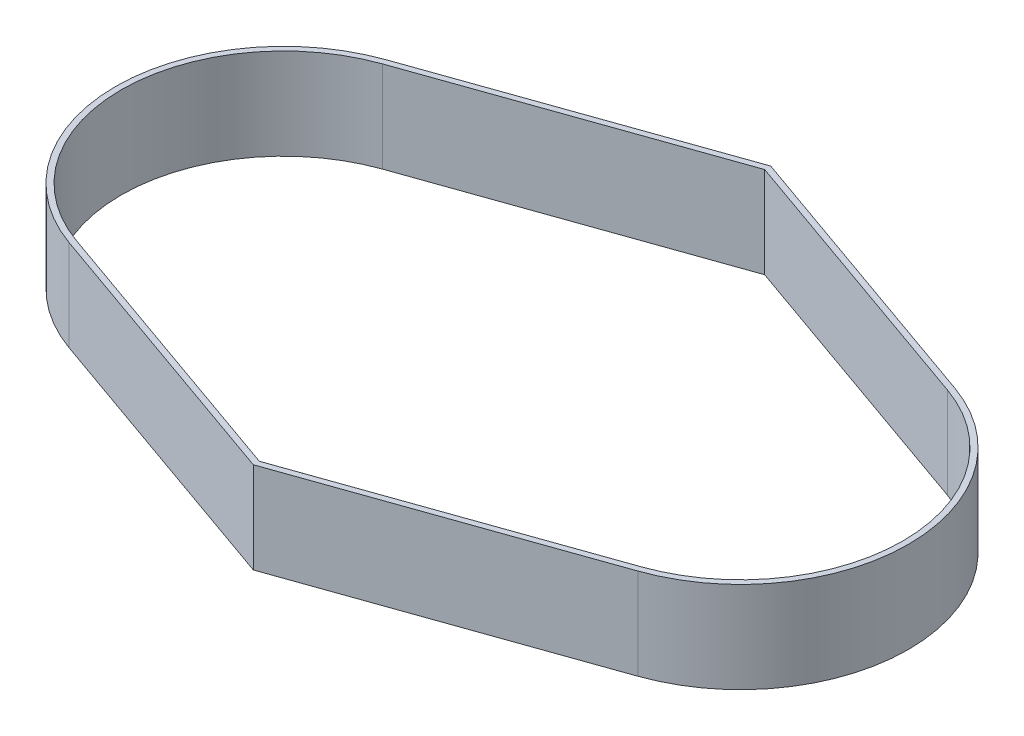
ISO-10303-21;
HEADER;
FILE_DESCRIPTION(('STEP AP214'),'2;1');
FILE_NAME('part.step','',(''),(''),'','','');
FILE_SCHEMA(('AUTOMOTIVE_DESIGN { 1 0 10303 214 1 1 1 1 }'));
ENDSEC;
DATA;
#1=APPLICATION_CONTEXT('core data for automotive mechanical design processes');
#2=APPLICATION_PROTOCOL_DEFINITION('international standard','automotive_design',2000,#1);
#3=PRODUCT_CONTEXT('',#1,'mechanical');
#4=PRODUCT('Part','Part','',(#3));
#5=PRODUCT_RELATED_PRODUCT_CATEGORY('part','',(#4));
#6=PRODUCT_DEFINITION_FORMATION('','',#4);
#7=PRODUCT_DEFINITION_CONTEXT('part definition',#1,'design');
#8=PRODUCT_DEFINITION('design','',#6,#7);
#9=PRODUCT_DEFINITION_SHAPE('','',#8);
#10=(LENGTH_UNIT() NAMED_UNIT(*) SI_UNIT(.MILLI.,.METRE.));
#11=(NAMED_UNIT(*) PLANE_ANGLE_UNIT() SI_UNIT($,.RADIAN.));
#12=(NAMED_UNIT(*) SI_UNIT($,.STERADIAN.) SOLID_ANGLE_UNIT());
#13=UNCERTAINTY_MEASURE_WITH_UNIT(LENGTH_MEASURE(1.E-05),#10,'distance_accuracy_value','');
#14=(GEOMETRIC_REPRESENTATION_CONTEXT(3) GLOBAL_UNCERTAINTY_ASSIGNED_CONTEXT((#13)) GLOBAL_UNIT_ASSIGNED_CONTEXT((#10,
#11,#12)) REPRESENTATION_CONTEXT('',''));
#15=CARTESIAN_POINT('',(0.,0.,0.));
#16=DIRECTION('',(0.,0.,1.));
#17=DIRECTION('',(1.,0.,0.));
#18=AXIS2_PLACEMENT_3D('',#15,#16,#17);
#19=CARTESIAN_POINT('',(-127.367353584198,50.8,0.));
#20=DIRECTION('',(0.,1.,0.));
#21=DIRECTION('',(0.,0.,1.));
#22=AXIS2_PLACEMENT_3D('',#19,#20,#21);
#23=PLANE('',#22);
#24=CARTESIAN_POINT('',(-127.367353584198,50.8,0.));
#25=DIRECTION('',(0.,1.,0.));
#26=DIRECTION('',(0.,0.,1.));
#27=AXIS2_PLACEMENT_3D('',#24,#25,#26);
#28=CIRCLE('',#27,93.6625);
#29=CARTESIAN_POINT('',(-158.505524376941,50.8,-88.3350339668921));
#30=VERTEX_POINT('',#29);
#31=CARTESIAN_POINT('',(-158.505524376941,50.8,88.3350339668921));
#32=VERTEX_POINT('',#31);
#33=EDGE_CURVE('E213',#30,#32,#28,.T.);
#34=ORIENTED_EDGE('',*,*,#33,.T.);
#35=DIRECTION('',(0.943120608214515,0.,0.332450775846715));
#36=VECTOR('',#35,1.);
#37=CARTESIAN_POINT('',(-158.505524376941,50.8,88.3350339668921));
#38=LINE('',#37,#36);
#39=CARTESIAN_POINT('',(0.,50.8,144.20835928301));
#40=VERTEX_POINT('',#39);
#41=EDGE_CURVE('E217',#32,#40,#38,.T.);
#42=ORIENTED_EDGE('',*,*,#41,.T.);
#43=DIRECTION('',(0.943120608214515,0.,-0.332450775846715));
#44=VECTOR('',#43,1.);
#45=CARTESIAN_POINT('',(158.505524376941,50.8,88.3350339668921));
#46=LINE('',#45,#44);
#47=CARTESIAN_POINT('',(158.505524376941,50.8,88.3350339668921));
#48=VERTEX_POINT('',#47);
#49=EDGE_CURVE('E220',#40,#48,#46,.T.);
#50=ORIENTED_EDGE('',*,*,#49,.T.);
#51=CARTESIAN_POINT('',(127.367353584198,50.8,0.));
#52=DIRECTION('',(0.,1.,0.));
#53=DIRECTION('',(0.,0.,-1.));
#54=AXIS2_PLACEMENT_3D('',#51,#52,#53);
#55=CIRCLE('',#54,93.6625);
#56=CARTESIAN_POINT('',(158.505524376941,50.8,-88.3350339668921));
#57=VERTEX_POINT('',#56);
#58=EDGE_CURVE('E223',#48,#57,#55,.T.);
#59=ORIENTED_EDGE('',*,*,#58,.T.);
#60=DIRECTION('',(-0.943120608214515,0.,-0.332450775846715));
#61=VECTOR('',#60,1.);
#62=CARTESIAN_POINT('',(158.505524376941,50.8,-88.3350339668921));
#63=LINE('',#62,#61);
#64=CARTESIAN_POINT('',(0.,50.8,-144.20835928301));
#65=VERTEX_POINT('',#64);
#66=EDGE_CURVE('E226',#57,#65,#63,.T.);
#67=ORIENTED_EDGE('',*,*,#66,.T.);
#68=DIRECTION('',(-0.943120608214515,0.,0.332450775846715));
#69=VECTOR('',#68,1.);
#70=CARTESIAN_POINT('',(-158.505524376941,50.8,-88.3350339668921));
#71=LINE('',#70,#69);
#72=EDGE_CURVE('E228',#65,#30,#71,.T.);
#73=ORIENTED_EDGE('',*,*,#72,.T.);
#74=EDGE_LOOP('',(#34,#42,#50,#59,#67,#73));
#75=FACE_BOUND('',#74,.T.);
#76=DIRECTION('',(0.943120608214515,0.,0.332450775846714));
#77=VECTOR('',#76,1.);
#78=CARTESIAN_POINT('',(-157.449993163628,50.8,85.340626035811));
#79=LINE('',#78,#77);
#80=CARTESIAN_POINT('',(-157.449993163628,50.8,85.340626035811));
#81=VERTEX_POINT('',#80);
#82=CARTESIAN_POINT('',(0.,50.8,140.841875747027));
#83=VERTEX_POINT('',#82);
#84=EDGE_CURVE('E155',#81,#83,#79,.T.);
#85=ORIENTED_EDGE('',*,*,#84,.F.);
#86=CARTESIAN_POINT('',(-127.367353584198,50.8,0.));
#87=DIRECTION('',(0.,1.,0.));
#88=DIRECTION('',(0.,0.,1.));
#89=AXIS2_PLACEMENT_3D('',#86,#87,#88);
#90=CIRCLE('',#89,90.4875);
#91=CARTESIAN_POINT('',(-157.449993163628,50.8,-85.340626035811));
#92=VERTEX_POINT('',#91);
#93=EDGE_CURVE('E146',#92,#81,#90,.T.);
#94=ORIENTED_EDGE('',*,*,#93,.F.);
#95=DIRECTION('',(-0.943120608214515,0.,0.332450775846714));
#96=VECTOR('',#95,1.);
#97=CARTESIAN_POINT('',(-157.449993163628,50.8,-85.340626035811));
#98=LINE('',#97,#96);
#99=CARTESIAN_POINT('',(0.,50.8,-140.841875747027));
#100=VERTEX_POINT('',#99);
#101=EDGE_CURVE('E182',#100,#92,#98,.T.);
#102=ORIENTED_EDGE('',*,*,#101,.F.);
#103=DIRECTION('',(-0.943120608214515,0.,-0.332450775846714));
#104=VECTOR('',#103,1.);
#105=CARTESIAN_POINT('',(157.449993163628,50.8,-85.340626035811));
#106=LINE('',#105,#104);
#107=CARTESIAN_POINT('',(157.449993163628,50.8,-85.340626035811));
#108=VERTEX_POINT('',#107);
#109=EDGE_CURVE('E180',#108,#100,#106,.T.);
#110=ORIENTED_EDGE('',*,*,#109,.F.);
#111=CARTESIAN_POINT('',(127.367353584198,50.8,0.));
#112=DIRECTION('',(0.,1.,0.));
#113=DIRECTION('',(0.,0.,-1.));
#114=AXIS2_PLACEMENT_3D('',#111,#112,#113);
#115=CIRCLE('',#114,90.4875);
#116=CARTESIAN_POINT('',(157.449993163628,50.8,85.3406260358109));
#117=VERTEX_POINT('',#116);
#118=EDGE_CURVE('E175',#117,#108,#115,.T.);
#119=ORIENTED_EDGE('',*,*,#118,.F.);
#120=DIRECTION('',(0.943120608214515,0.,-0.332450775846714));
#121=VECTOR('',#120,1.);
#122=CARTESIAN_POINT('',(157.449993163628,50.8,85.340626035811));
#123=LINE('',#122,#121);
#124=EDGE_CURVE('E169',#83,#117,#123,.T.);
#125=ORIENTED_EDGE('',*,*,#124,.F.);
#126=EDGE_LOOP('',(#85,#94,#102,#110,#119,#125));
#127=FACE_BOUND('',#126,.T.);
#128=ADVANCED_FACE('F44',(#75,#127),#23,.T.);
#129=CARTESIAN_POINT('',(-127.367353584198,0.,0.));
#130=DIRECTION('',(0.,1.,0.));
#131=DIRECTION('',(0.,0.,1.));
#132=AXIS2_PLACEMENT_3D('',#129,#130,#131);
#133=PLANE('',#132);
#134=CARTESIAN_POINT('',(-127.367353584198,0.,0.));
#135=DIRECTION('',(0.,1.,0.));
#136=DIRECTION('',(0.,0.,1.));
#137=AXIS2_PLACEMENT_3D('',#134,#135,#136);
#138=CIRCLE('',#137,93.6625);
#139=CARTESIAN_POINT('',(-158.505524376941,0.,-88.3350339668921));
#140=VERTEX_POINT('',#139);
#141=CARTESIAN_POINT('',(-158.505524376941,0.,88.3350339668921));
#142=VERTEX_POINT('',#141);
#143=EDGE_CURVE('E164',#140,#142,#138,.T.);
#144=ORIENTED_EDGE('',*,*,#143,.F.);
#145=DIRECTION('',(-0.943120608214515,0.,0.332450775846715));
#146=VECTOR('',#145,1.);
#147=CARTESIAN_POINT('',(-158.505524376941,0.,-88.3350339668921));
#148=LINE('',#147,#146);
#149=CARTESIAN_POINT('',(0.,0.,-144.20835928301));
#150=VERTEX_POINT('',#149);
#151=EDGE_CURVE('E218',#150,#140,#148,.T.);
#152=ORIENTED_EDGE('',*,*,#151,.F.);
#153=DIRECTION('',(-0.943120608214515,0.,-0.332450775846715));
#154=VECTOR('',#153,1.);
#155=CARTESIAN_POINT('',(158.505524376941,0.,-88.3350339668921));
#156=LINE('',#155,#154);
#157=CARTESIAN_POINT('',(158.505524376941,0.,-88.3350339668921));
#158=VERTEX_POINT('',#157);
#159=EDGE_CURVE('E243',#158,#150,#156,.T.);
#160=ORIENTED_EDGE('',*,*,#159,.F.);
#161=CARTESIAN_POINT('',(127.367353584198,0.,0.));
#162=DIRECTION('',(0.,1.,0.));
#163=DIRECTION('',(0.,0.,-1.));
#164=AXIS2_PLACEMENT_3D('',#161,#162,#163);
#165=CIRCLE('',#164,93.6625);
#166=CARTESIAN_POINT('',(158.505524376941,0.,88.3350339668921));
#167=VERTEX_POINT('',#166);
#168=EDGE_CURVE('E241',#167,#158,#165,.T.);
#169=ORIENTED_EDGE('',*,*,#168,.F.);
#170=DIRECTION('',(0.943120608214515,0.,-0.332450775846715));
#171=VECTOR('',#170,1.);
#172=CARTESIAN_POINT('',(158.505524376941,0.,88.3350339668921));
#173=LINE('',#172,#171);
#174=CARTESIAN_POINT('',(0.,0.,144.20835928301));
#175=VERTEX_POINT('',#174);
#176=EDGE_CURVE('E238',#175,#167,#173,.T.);
#177=ORIENTED_EDGE('',*,*,#176,.F.);
#178=DIRECTION('',(0.943120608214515,0.,0.332450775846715));
#179=VECTOR('',#178,1.);
#180=CARTESIAN_POINT('',(-158.505524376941,0.,88.3350339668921));
#181=LINE('',#180,#179);
#182=EDGE_CURVE('E235',#142,#175,#181,.T.);
#183=ORIENTED_EDGE('',*,*,#182,.F.);
#184=EDGE_LOOP('',(#144,#152,#160,#169,#177,#183));
#185=FACE_BOUND('',#184,.T.);
#186=CARTESIAN_POINT('',(-127.367353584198,0.,0.));
#187=DIRECTION('',(0.,1.,0.));
#188=DIRECTION('',(0.,0.,1.));
#189=AXIS2_PLACEMENT_3D('',#186,#187,#188);
#190=CIRCLE('',#189,90.4875);
#191=CARTESIAN_POINT('',(-157.449993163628,0.,-85.340626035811));
#192=VERTEX_POINT('',#191);
#193=CARTESIAN_POINT('',(-157.449993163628,0.,85.340626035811));
#194=VERTEX_POINT('',#193);
#195=EDGE_CURVE('E71',#192,#194,#190,.T.);
#196=ORIENTED_EDGE('',*,*,#195,.T.);
#197=DIRECTION('',(0.943120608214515,0.,0.332450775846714));
#198=VECTOR('',#197,1.);
#199=CARTESIAN_POINT('',(-157.449993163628,0.,85.340626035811));
#200=LINE('',#199,#198);
#201=CARTESIAN_POINT('',(0.,0.,140.841875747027));
#202=VERTEX_POINT('',#201);
#203=EDGE_CURVE('E162',#194,#202,#200,.T.);
#204=ORIENTED_EDGE('',*,*,#203,.T.);
#205=DIRECTION('',(0.943120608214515,0.,-0.332450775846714));
#206=VECTOR('',#205,1.);
#207=CARTESIAN_POINT('',(157.449993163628,0.,85.340626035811));
#208=LINE('',#207,#206);
#209=CARTESIAN_POINT('',(157.449993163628,0.,85.3406260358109));
#210=VERTEX_POINT('',#209);
#211=EDGE_CURVE('E189',#202,#210,#208,.T.);
#212=ORIENTED_EDGE('',*,*,#211,.T.);
#213=CARTESIAN_POINT('',(127.367353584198,0.,0.));
#214=DIRECTION('',(0.,1.,0.));
#215=DIRECTION('',(0.,0.,-1.));
#216=AXIS2_PLACEMENT_3D('',#213,#214,#215);
#217=CIRCLE('',#216,90.4875);
#218=CARTESIAN_POINT('',(157.449993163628,0.,-85.340626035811));
#219=VERTEX_POINT('',#218);
#220=EDGE_CURVE('E193',#210,#219,#217,.T.);
#221=ORIENTED_EDGE('',*,*,#220,.T.);
#222=DIRECTION('',(-0.943120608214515,0.,-0.332450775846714));
#223=VECTOR('',#222,1.);
#224=CARTESIAN_POINT('',(157.449993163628,0.,-85.340626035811));
#225=LINE('',#224,#223);
#226=CARTESIAN_POINT('',(0.,0.,-140.841875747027));
#227=VERTEX_POINT('',#226);
#228=EDGE_CURVE('E196',#219,#227,#225,.T.);
#229=ORIENTED_EDGE('',*,*,#228,.T.);
#230=DIRECTION('',(-0.943120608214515,0.,0.332450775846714));
#231=VECTOR('',#230,1.);
#232=CARTESIAN_POINT('',(-157.449993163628,0.,-85.340626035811));
#233=LINE('',#232,#231);
#234=EDGE_CURVE('E156',#227,#192,#233,.T.);
#235=ORIENTED_EDGE('',*,*,#234,.T.);
#236=EDGE_LOOP('',(#196,#204,#212,#221,#229,#235));
#237=FACE_BOUND('',#236,.T.);
#238=ADVANCED_FACE('F271',(#185,#237),#133,.F.);
#239=CARTESIAN_POINT('',(-127.367353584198,50.8,0.));
#240=DIRECTION('',(0.,-1.,0.));
#241=DIRECTION('',(0.,0.,-1.));
#242=AXIS2_PLACEMENT_3D('',#239,#240,#241);
#243=CYLINDRICAL_SURFACE('',#242,93.6625);
#244=ORIENTED_EDGE('',*,*,#143,.T.);
#245=DIRECTION('',(0.,-1.,0.));
#246=VECTOR('',#245,1.);
#247=CARTESIAN_POINT('',(-158.505524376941,50.8,88.3350339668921));
#248=LINE('',#247,#246);
#249=EDGE_CURVE('E11',#32,#142,#248,.T.);
#250=ORIENTED_EDGE('',*,*,#249,.F.);
#251=ORIENTED_EDGE('',*,*,#33,.F.);
#252=DIRECTION('',(0.,-1.,0.));
#253=VECTOR('',#252,1.);
#254=CARTESIAN_POINT('',(-158.505524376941,50.8,-88.3350339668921));
#255=LINE('',#254,#253);
#256=EDGE_CURVE('E231',#30,#140,#255,.T.);
#257=ORIENTED_EDGE('',*,*,#256,.T.);
#258=EDGE_LOOP('',(#244,#250,#251,#257));
#259=FACE_BOUND('',#258,.T.);
#260=ADVANCED_FACE('F46',(#259),#243,.T.);
#261=CARTESIAN_POINT('',(-158.505524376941,50.8,88.3350339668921));
#262=DIRECTION('',(0.332450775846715,0.,-0.943120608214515));
#263=DIRECTION('',(-0.943120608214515,0.,-0.332450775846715));
#264=AXIS2_PLACEMENT_3D('',#261,#262,#263);
#265=PLANE('',#264);
#266=ORIENTED_EDGE('',*,*,#182,.T.);
#267=DIRECTION('',(0.,-1.,0.));
#268=VECTOR('',#267,1.);
#269=CARTESIAN_POINT('',(0.,50.8,144.20835928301));
#270=LINE('',#269,#268);
#271=EDGE_CURVE('E53',#40,#175,#270,.T.);
#272=ORIENTED_EDGE('',*,*,#271,.F.);
#273=ORIENTED_EDGE('',*,*,#41,.F.);
#274=ORIENTED_EDGE('',*,*,#249,.T.);
#275=EDGE_LOOP('',(#266,#272,#273,#274));
#276=FACE_BOUND('',#275,.T.);
#277=ADVANCED_FACE('F288',(#276),#265,.F.);
#278=CARTESIAN_POINT('',(158.505524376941,50.8,88.3350339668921));
#279=DIRECTION('',(-0.332450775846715,0.,-0.943120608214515));
#280=DIRECTION('',(-0.943120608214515,0.,0.332450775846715));
#281=AXIS2_PLACEMENT_3D('',#278,#279,#280);
#282=PLANE('',#281);
#283=ORIENTED_EDGE('',*,*,#176,.T.);
#284=DIRECTION('',(0.,-1.,0.));
#285=VECTOR('',#284,1.);
#286=CARTESIAN_POINT('',(158.505524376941,50.8,88.3350339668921));
#287=LINE('',#286,#285);
#288=EDGE_CURVE('E257',#48,#167,#287,.T.);
#289=ORIENTED_EDGE('',*,*,#288,.F.);
#290=ORIENTED_EDGE('',*,*,#49,.F.);
#291=ORIENTED_EDGE('',*,*,#271,.T.);
#292=EDGE_LOOP('',(#283,#289,#290,#291));
#293=FACE_BOUND('',#292,.T.);
#294=ADVANCED_FACE('F265',(#293),#282,.F.);
#295=CARTESIAN_POINT('',(127.367353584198,50.8,0.));
#296=DIRECTION('',(0.,-1.,0.));
#297=DIRECTION('',(0.,0.,-1.));
#298=AXIS2_PLACEMENT_3D('',#295,#296,#297);
#299=CYLINDRICAL_SURFACE('',#298,93.6625);
#300=ORIENTED_EDGE('',*,*,#168,.T.);
#301=DIRECTION('',(0.,-1.,0.));
#302=VECTOR('',#301,1.);
#303=CARTESIAN_POINT('',(158.505524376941,50.8,-88.3350339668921));
#304=LINE('',#303,#302);
#305=EDGE_CURVE('E254',#57,#158,#304,.T.);
#306=ORIENTED_EDGE('',*,*,#305,.F.);
#307=ORIENTED_EDGE('',*,*,#58,.F.);
#308=ORIENTED_EDGE('',*,*,#288,.T.);
#309=EDGE_LOOP('',(#300,#306,#307,#308));
#310=FACE_BOUND('',#309,.T.);
#311=ADVANCED_FACE('F277',(#310),#299,.T.);
#312=CARTESIAN_POINT('',(158.505524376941,50.8,-88.3350339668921));
#313=DIRECTION('',(-0.332450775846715,0.,0.943120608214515));
#314=DIRECTION('',(0.943120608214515,0.,0.332450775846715));
#315=AXIS2_PLACEMENT_3D('',#312,#313,#314);
#316=PLANE('',#315);
#317=ORIENTED_EDGE('',*,*,#159,.T.);
#318=DIRECTION('',(0.,-1.,0.));
#319=VECTOR('',#318,1.);
#320=CARTESIAN_POINT('',(0.,50.8,-144.20835928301));
#321=LINE('',#320,#319);
#322=EDGE_CURVE('E250',#65,#150,#321,.T.);
#323=ORIENTED_EDGE('',*,*,#322,.F.);
#324=ORIENTED_EDGE('',*,*,#66,.F.);
#325=ORIENTED_EDGE('',*,*,#305,.T.);
#326=EDGE_LOOP('',(#317,#323,#324,#325));
#327=FACE_BOUND('',#326,.T.);
#328=ADVANCED_FACE('F281',(#327),#316,.F.);
#329=CARTESIAN_POINT('',(-158.505524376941,50.8,-88.3350339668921));
#330=DIRECTION('',(0.332450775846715,0.,0.943120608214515));
#331=DIRECTION('',(0.943120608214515,0.,-0.332450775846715));
#332=AXIS2_PLACEMENT_3D('',#329,#330,#331);
#333=PLANE('',#332);
#334=ORIENTED_EDGE('',*,*,#151,.T.);
#335=ORIENTED_EDGE('',*,*,#256,.F.);
#336=ORIENTED_EDGE('',*,*,#72,.F.);
#337=ORIENTED_EDGE('',*,*,#322,.T.);
#338=EDGE_LOOP('',(#334,#335,#336,#337));
#339=FACE_BOUND('',#338,.T.);
#340=ADVANCED_FACE('F291',(#339),#333,.F.);
#341=CARTESIAN_POINT('',(-127.367353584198,50.8,0.));
#342=DIRECTION('',(0.,-1.,0.));
#343=DIRECTION('',(0.,0.,-1.));
#344=AXIS2_PLACEMENT_3D('',#341,#342,#343);
#345=CYLINDRICAL_SURFACE('',#344,90.4875);
#346=ORIENTED_EDGE('',*,*,#195,.F.);
#347=DIRECTION('',(0.,-1.,0.));
#348=VECTOR('',#347,1.);
#349=CARTESIAN_POINT('',(-157.449993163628,50.8,-85.340626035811));
#350=LINE('',#349,#348);
#351=EDGE_CURVE('E150',#92,#192,#350,.T.);
#352=ORIENTED_EDGE('',*,*,#351,.F.);
#353=ORIENTED_EDGE('',*,*,#93,.T.);
#354=DIRECTION('',(0.,-1.,0.));
#355=VECTOR('',#354,1.);
#356=CARTESIAN_POINT('',(-157.449993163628,50.8,85.340626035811));
#357=LINE('',#356,#355);
#358=EDGE_CURVE('E149',#81,#194,#357,.T.);
#359=ORIENTED_EDGE('',*,*,#358,.T.);
#360=EDGE_LOOP('',(#346,#352,#353,#359));
#361=FACE_BOUND('',#360,.T.);
#362=ADVANCED_FACE('F148',(#361),#345,.F.);
#363=CARTESIAN_POINT('',(-157.449993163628,50.8,85.340626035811));
#364=DIRECTION('',(0.332450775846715,0.,-0.943120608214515));
#365=DIRECTION('',(-0.943120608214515,0.,-0.332450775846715));
#366=AXIS2_PLACEMENT_3D('',#363,#364,#365);
#367=PLANE('',#366);
#368=ORIENTED_EDGE('',*,*,#203,.F.);
#369=ORIENTED_EDGE('',*,*,#358,.F.);
#370=ORIENTED_EDGE('',*,*,#84,.T.);
#371=DIRECTION('',(0.,-1.,0.));
#372=VECTOR('',#371,1.);
#373=CARTESIAN_POINT('',(0.,50.8,140.841875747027));
#374=LINE('',#373,#372);
#375=EDGE_CURVE('E165',#83,#202,#374,.T.);
#376=ORIENTED_EDGE('',*,*,#375,.T.);
#377=EDGE_LOOP('',(#368,#369,#370,#376));
#378=FACE_BOUND('',#377,.T.);
#379=ADVANCED_FACE('F159',(#378),#367,.T.);
#380=CARTESIAN_POINT('',(157.449993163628,50.8,85.340626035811));
#381=DIRECTION('',(-0.332450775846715,0.,-0.943120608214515));
#382=DIRECTION('',(-0.943120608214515,0.,0.332450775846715));
#383=AXIS2_PLACEMENT_3D('',#380,#381,#382);
#384=PLANE('',#383);
#385=ORIENTED_EDGE('',*,*,#211,.F.);
#386=ORIENTED_EDGE('',*,*,#375,.F.);
#387=ORIENTED_EDGE('',*,*,#124,.T.);
#388=DIRECTION('',(0.,-1.,0.));
#389=VECTOR('',#388,1.);
#390=CARTESIAN_POINT('',(157.449993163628,50.8,85.3406260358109));
#391=LINE('',#390,#389);
#392=EDGE_CURVE('E209',#117,#210,#391,.T.);
#393=ORIENTED_EDGE('',*,*,#392,.T.);
#394=EDGE_LOOP('',(#385,#386,#387,#393));
#395=FACE_BOUND('',#394,.T.);
#396=ADVANCED_FACE('F309',(#395),#384,.T.);
#397=CARTESIAN_POINT('',(127.367353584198,50.8,0.));
#398=DIRECTION('',(0.,-1.,0.));
#399=DIRECTION('',(0.,0.,-1.));
#400=AXIS2_PLACEMENT_3D('',#397,#398,#399);
#401=CYLINDRICAL_SURFACE('',#400,90.4875);
#402=ORIENTED_EDGE('',*,*,#220,.F.);
#403=ORIENTED_EDGE('',*,*,#392,.F.);
#404=ORIENTED_EDGE('',*,*,#118,.T.);
#405=DIRECTION('',(0.,-1.,0.));
#406=VECTOR('',#405,1.);
#407=CARTESIAN_POINT('',(157.449993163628,50.8,-85.340626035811));
#408=LINE('',#407,#406);
#409=EDGE_CURVE('E207',#108,#219,#408,.T.);
#410=ORIENTED_EDGE('',*,*,#409,.T.);
#411=EDGE_LOOP('',(#402,#403,#404,#410));
#412=FACE_BOUND('',#411,.T.);
#413=ADVANCED_FACE('F312',(#412),#401,.F.);
#414=CARTESIAN_POINT('',(157.449993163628,50.8,-85.340626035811));
#415=DIRECTION('',(-0.332450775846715,0.,0.943120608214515));
#416=DIRECTION('',(0.943120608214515,0.,0.332450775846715));
#417=AXIS2_PLACEMENT_3D('',#414,#415,#416);
#418=PLANE('',#417);
#419=ORIENTED_EDGE('',*,*,#228,.F.);
#420=ORIENTED_EDGE('',*,*,#409,.F.);
#421=ORIENTED_EDGE('',*,*,#109,.T.);
#422=DIRECTION('',(0.,-1.,0.));
#423=VECTOR('',#422,1.);
#424=CARTESIAN_POINT('',(0.,50.8,-140.841875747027));
#425=LINE('',#424,#423);
#426=EDGE_CURVE('E60',#100,#227,#425,.T.);
#427=ORIENTED_EDGE('',*,*,#426,.T.);
#428=EDGE_LOOP('',(#419,#420,#421,#427));
#429=FACE_BOUND('',#428,.T.);
#430=ADVANCED_FACE('F316',(#429),#418,.T.);
#431=CARTESIAN_POINT('',(-157.449993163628,50.8,-85.340626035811));
#432=DIRECTION('',(0.332450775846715,0.,0.943120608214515));
#433=DIRECTION('',(0.943120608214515,0.,-0.332450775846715));
#434=AXIS2_PLACEMENT_3D('',#431,#432,#433);
#435=PLANE('',#434);
#436=ORIENTED_EDGE('',*,*,#234,.F.);
#437=ORIENTED_EDGE('',*,*,#426,.F.);
#438=ORIENTED_EDGE('',*,*,#101,.T.);
#439=ORIENTED_EDGE('',*,*,#351,.T.);
#440=EDGE_LOOP('',(#436,#437,#438,#439));
#441=FACE_BOUND('',#440,.T.);
#442=ADVANCED_FACE('F320',(#441),#435,.T.);
#443=CLOSED_SHELL('',(#128,#238,#260,#277,#294,#311,#328,#340,#362,#379,#396,#413,#430,#442));
#444=MANIFOLD_SOLID_BREP('B2',#443);
#445=ADVANCED_BREP_SHAPE_REPRESENTATION('',(#18,#444),#14);
#446=SHAPE_DEFINITION_REPRESENTATION(#9,#445);
ENDSEC;
END-ISO-10303-21;
